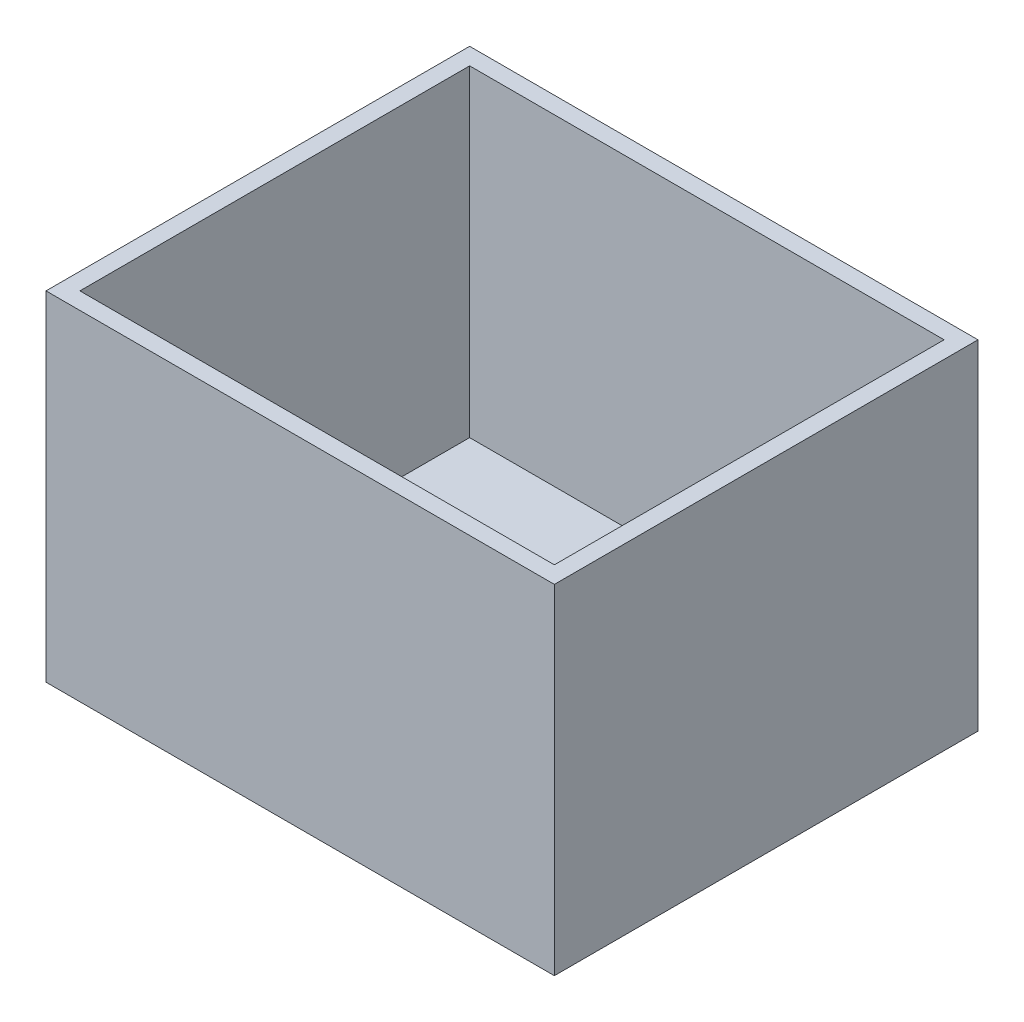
from build123d import *

# Parameters (mm, degrees)
ESQUISSE1_W             = 60
ESQUISSE1_H             = 40
BOSS_EXTRU_1_DEPTH      = 25
ESQUISSE3_W             = 56
ESQUISSE3_H             = 46
ENL_V_MAT_EXTRU_1_DEPTH = 38


with BuildPart() as part:
    # Esquisse1 → Boss.-Extru.1 (new, symmetric)
    with BuildSketch(Plane.XY):
        with Locations((30, 20)):
            Rectangle(ESQUISSE1_W, ESQUISSE1_H)
    extrude(amount=BOSS_EXTRU_1_DEPTH, both=True)

    # Esquisse3 → Enl_v. mat.-Extru.1 (cut)
    with BuildSketch(Plane(origin=(0, 40, 0), x_dir=(1, 0, 0), z_dir=(0, 1, 0))):
        with Locations((30, 0)):
            Rectangle(ESQUISSE3_W, ESQUISSE3_H)
    extrude(amount=-ENL_V_MAT_EXTRU_1_DEPTH, mode=Mode.SUBTRACT)


solid = part.part
